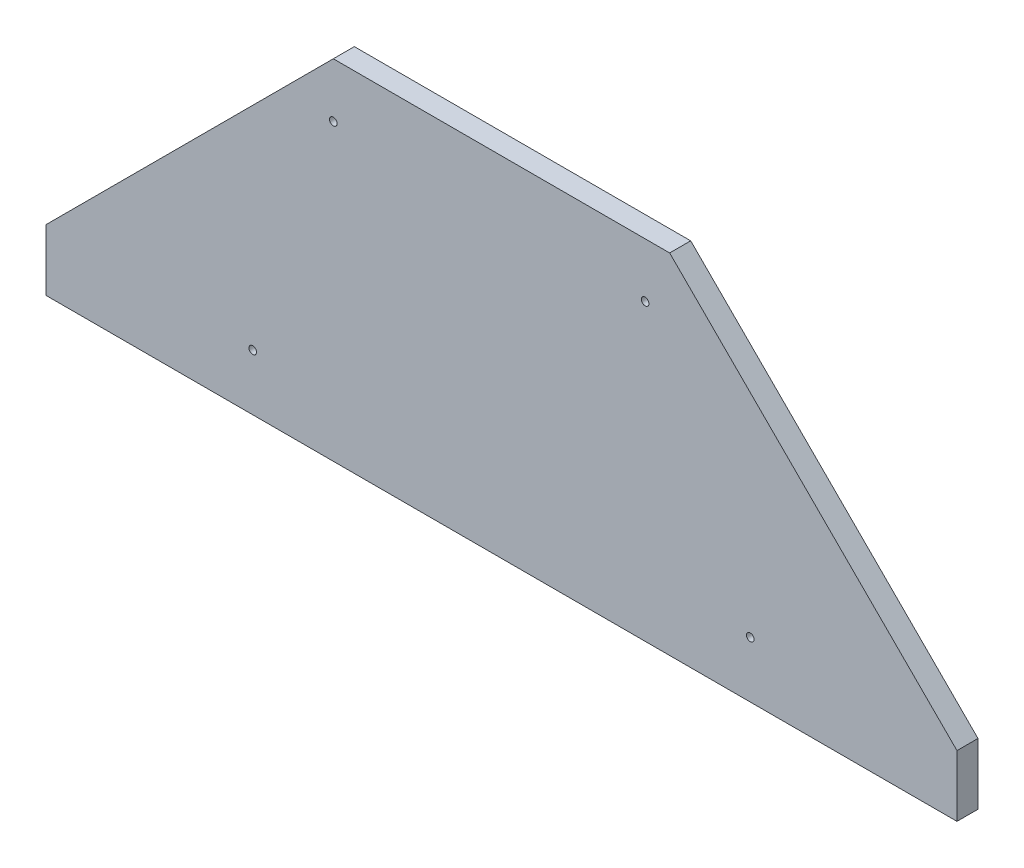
ISO-10303-21;
HEADER;
FILE_DESCRIPTION(('STEP AP214'),'2;1');
FILE_NAME('part.step','',(''),(''),'','','');
FILE_SCHEMA(('AUTOMOTIVE_DESIGN { 1 0 10303 214 1 1 1 1 }'));
ENDSEC;
DATA;
#1=APPLICATION_CONTEXT('core data for automotive mechanical design processes');
#2=APPLICATION_PROTOCOL_DEFINITION('international standard','automotive_design',2000,#1);
#3=PRODUCT_CONTEXT('',#1,'mechanical');
#4=PRODUCT('Part','Part','',(#3));
#5=PRODUCT_RELATED_PRODUCT_CATEGORY('part','',(#4));
#6=PRODUCT_DEFINITION_FORMATION('','',#4);
#7=PRODUCT_DEFINITION_CONTEXT('part definition',#1,'design');
#8=PRODUCT_DEFINITION('design','',#6,#7);
#9=PRODUCT_DEFINITION_SHAPE('','',#8);
#10=(LENGTH_UNIT() NAMED_UNIT(*) SI_UNIT(.MILLI.,.METRE.));
#11=(NAMED_UNIT(*) PLANE_ANGLE_UNIT() SI_UNIT($,.RADIAN.));
#12=(NAMED_UNIT(*) SI_UNIT($,.STERADIAN.) SOLID_ANGLE_UNIT());
#13=UNCERTAINTY_MEASURE_WITH_UNIT(LENGTH_MEASURE(1.E-05),#10,'distance_accuracy_value','');
#14=(GEOMETRIC_REPRESENTATION_CONTEXT(3) GLOBAL_UNCERTAINTY_ASSIGNED_CONTEXT((#13)) GLOBAL_UNIT_ASSIGNED_CONTEXT((#10,
#11,#12)) REPRESENTATION_CONTEXT('',''));
#15=CARTESIAN_POINT('',(0.,0.,0.));
#16=DIRECTION('',(0.,0.,1.));
#17=DIRECTION('',(1.,0.,0.));
#18=AXIS2_PLACEMENT_3D('',#15,#16,#17);
#19=CARTESIAN_POINT('',(0.,157.95625,9.525));
#20=DIRECTION('',(0.,1.,0.));
#21=DIRECTION('',(0.,0.,1.));
#22=AXIS2_PLACEMENT_3D('',#19,#20,#21);
#23=PLANE('',#22);
#24=DIRECTION('',(1.,0.,0.));
#25=VECTOR('',#24,1.);
#26=CARTESIAN_POINT('',(0.,157.95625,-9.525));
#27=LINE('',#26,#25);
#28=CARTESIAN_POINT('',(-152.4,157.95625,-9.525));
#29=VERTEX_POINT('',#28);
#30=CARTESIAN_POINT('',(152.4,157.95625,-9.525));
#31=VERTEX_POINT('',#30);
#32=EDGE_CURVE('E126',#29,#31,#27,.T.);
#33=ORIENTED_EDGE('',*,*,#32,.F.);
#34=DIRECTION('',(0.,0.,-1.));
#35=VECTOR('',#34,1.);
#36=CARTESIAN_POINT('',(-152.4,157.95625,9.525));
#37=LINE('',#36,#35);
#38=CARTESIAN_POINT('',(-152.4,157.95625,9.525));
#39=VERTEX_POINT('',#38);
#40=EDGE_CURVE('E11',#39,#29,#37,.T.);
#41=ORIENTED_EDGE('',*,*,#40,.F.);
#42=DIRECTION('',(1.,0.,0.));
#43=VECTOR('',#42,1.);
#44=CARTESIAN_POINT('',(0.,157.95625,9.525));
#45=LINE('',#44,#43);
#46=CARTESIAN_POINT('',(152.4,157.95625,9.525));
#47=VERTEX_POINT('',#46);
#48=EDGE_CURVE('E280',#39,#47,#45,.T.);
#49=ORIENTED_EDGE('',*,*,#48,.T.);
#50=DIRECTION('',(0.,0.,-1.));
#51=VECTOR('',#50,1.);
#52=CARTESIAN_POINT('',(152.4,157.95625,9.525));
#53=LINE('',#52,#51);
#54=EDGE_CURVE('E49',#47,#31,#53,.T.);
#55=ORIENTED_EDGE('',*,*,#54,.T.);
#56=EDGE_LOOP('',(#33,#41,#49,#55));
#57=FACE_BOUND('',#56,.T.);
#58=ADVANCED_FACE('F32',(#57),#23,.T.);
#59=CARTESIAN_POINT('',(-498.999046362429,-188.642796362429,9.525));
#60=DIRECTION('',(0.707106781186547,-0.707106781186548,0.));
#61=DIRECTION('',(0.707106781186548,0.707106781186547,0.));
#62=AXIS2_PLACEMENT_3D('',#59,#60,#61);
#63=PLANE('',#62);
#64=DIRECTION('',(-0.707106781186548,-0.707106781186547,0.));
#65=VECTOR('',#64,1.);
#66=CARTESIAN_POINT('',(-498.999046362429,-188.642796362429,-9.525));
#67=LINE('',#66,#65);
#68=CARTESIAN_POINT('',(-412.75,-102.39375,-9.525));
#69=VERTEX_POINT('',#68);
#70=EDGE_CURVE('E123',#29,#69,#67,.T.);
#71=ORIENTED_EDGE('',*,*,#70,.T.);
#72=DIRECTION('',(0.,0.,-1.));
#73=VECTOR('',#72,1.);
#74=CARTESIAN_POINT('',(-412.75,-102.39375,9.525));
#75=LINE('',#74,#73);
#76=CARTESIAN_POINT('',(-412.75,-102.39375,9.525));
#77=VERTEX_POINT('',#76);
#78=EDGE_CURVE('E41',#77,#69,#75,.T.);
#79=ORIENTED_EDGE('',*,*,#78,.F.);
#80=DIRECTION('',(-0.707106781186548,-0.707106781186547,0.));
#81=VECTOR('',#80,1.);
#82=CARTESIAN_POINT('',(-498.999046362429,-188.642796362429,9.525));
#83=LINE('',#82,#81);
#84=EDGE_CURVE('E282',#39,#77,#83,.T.);
#85=ORIENTED_EDGE('',*,*,#84,.F.);
#86=ORIENTED_EDGE('',*,*,#40,.T.);
#87=EDGE_LOOP('',(#71,#79,#85,#86));
#88=FACE_BOUND('',#87,.T.);
#89=ADVANCED_FACE('F124',(#88),#63,.F.);
#90=CARTESIAN_POINT('',(-412.75,-687.641842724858,9.525));
#91=DIRECTION('',(-1.,0.,0.));
#92=DIRECTION('',(0.,0.,1.));
#93=AXIS2_PLACEMENT_3D('',#90,#91,#92);
#94=PLANE('',#93);
#95=DIRECTION('',(0.,1.,0.));
#96=VECTOR('',#95,1.);
#97=CARTESIAN_POINT('',(-412.75,-687.641842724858,-9.525));
#98=LINE('',#97,#96);
#99=CARTESIAN_POINT('',(-412.75,-157.95625,-9.525));
#100=VERTEX_POINT('',#99);
#101=EDGE_CURVE('E120',#100,#69,#98,.T.);
#102=ORIENTED_EDGE('',*,*,#101,.F.);
#103=DIRECTION('',(0.,0.,-1.));
#104=VECTOR('',#103,1.);
#105=CARTESIAN_POINT('',(-412.75,-157.95625,9.525));
#106=LINE('',#105,#104);
#107=CARTESIAN_POINT('',(-412.75,-157.95625,9.525));
#108=VERTEX_POINT('',#107);
#109=EDGE_CURVE('E109',#108,#100,#106,.T.);
#110=ORIENTED_EDGE('',*,*,#109,.F.);
#111=DIRECTION('',(0.,1.,0.));
#112=VECTOR('',#111,1.);
#113=CARTESIAN_POINT('',(-412.75,-687.641842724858,9.525));
#114=LINE('',#113,#112);
#115=EDGE_CURVE('E103',#108,#77,#114,.T.);
#116=ORIENTED_EDGE('',*,*,#115,.T.);
#117=ORIENTED_EDGE('',*,*,#78,.T.);
#118=EDGE_LOOP('',(#102,#110,#116,#117));
#119=FACE_BOUND('',#118,.T.);
#120=ADVANCED_FACE('F118',(#119),#94,.T.);
#121=CARTESIAN_POINT('',(0.,-157.95625,9.525));
#122=DIRECTION('',(0.,1.,0.));
#123=DIRECTION('',(0.,0.,1.));
#124=AXIS2_PLACEMENT_3D('',#121,#122,#123);
#125=PLANE('',#124);
#126=DIRECTION('',(1.,0.,0.));
#127=VECTOR('',#126,1.);
#128=CARTESIAN_POINT('',(0.,-157.95625,-9.525));
#129=LINE('',#128,#127);
#130=CARTESIAN_POINT('',(412.75,-157.95625,-9.525));
#131=VERTEX_POINT('',#130);
#132=EDGE_CURVE('E108',#100,#131,#129,.T.);
#133=ORIENTED_EDGE('',*,*,#132,.T.);
#134=DIRECTION('',(0.,0.,-1.));
#135=VECTOR('',#134,1.);
#136=CARTESIAN_POINT('',(412.75,-157.95625,9.525));
#137=LINE('',#136,#135);
#138=CARTESIAN_POINT('',(412.75,-157.95625,9.525));
#139=VERTEX_POINT('',#138);
#140=EDGE_CURVE('E91',#139,#131,#137,.T.);
#141=ORIENTED_EDGE('',*,*,#140,.F.);
#142=DIRECTION('',(1.,0.,0.));
#143=VECTOR('',#142,1.);
#144=CARTESIAN_POINT('',(0.,-157.95625,9.525));
#145=LINE('',#144,#143);
#146=EDGE_CURVE('E96',#108,#139,#145,.T.);
#147=ORIENTED_EDGE('',*,*,#146,.F.);
#148=ORIENTED_EDGE('',*,*,#109,.T.);
#149=EDGE_LOOP('',(#133,#141,#147,#148));
#150=FACE_BOUND('',#149,.T.);
#151=ADVANCED_FACE('F106',(#150),#125,.F.);
#152=CARTESIAN_POINT('',(412.75,-687.641842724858,9.525));
#153=DIRECTION('',(-1.,0.,0.));
#154=DIRECTION('',(0.,0.,1.));
#155=AXIS2_PLACEMENT_3D('',#152,#153,#154);
#156=PLANE('',#155);
#157=DIRECTION('',(0.,1.,0.));
#158=VECTOR('',#157,1.);
#159=CARTESIAN_POINT('',(412.75,-687.641842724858,-9.525));
#160=LINE('',#159,#158);
#161=CARTESIAN_POINT('',(412.75,-102.39375,-9.525));
#162=VERTEX_POINT('',#161);
#163=EDGE_CURVE('E130',#131,#162,#160,.T.);
#164=ORIENTED_EDGE('',*,*,#163,.T.);
#165=DIRECTION('',(0.,0.,-1.));
#166=VECTOR('',#165,1.);
#167=CARTESIAN_POINT('',(412.75,-102.39375,9.525));
#168=LINE('',#167,#166);
#169=CARTESIAN_POINT('',(412.75,-102.39375,9.525));
#170=VERTEX_POINT('',#169);
#171=EDGE_CURVE('E69',#170,#162,#168,.T.);
#172=ORIENTED_EDGE('',*,*,#171,.F.);
#173=DIRECTION('',(0.,1.,0.));
#174=VECTOR('',#173,1.);
#175=CARTESIAN_POINT('',(412.75,-687.641842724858,9.525));
#176=LINE('',#175,#174);
#177=EDGE_CURVE('E87',#139,#170,#176,.T.);
#178=ORIENTED_EDGE('',*,*,#177,.F.);
#179=ORIENTED_EDGE('',*,*,#140,.T.);
#180=EDGE_LOOP('',(#164,#172,#178,#179));
#181=FACE_BOUND('',#180,.T.);
#182=ADVANCED_FACE('F89',(#181),#156,.F.);
#183=CARTESIAN_POINT('',(130.175,108.74375,9.525));
#184=DIRECTION('',(0.,0.,-1.));
#185=DIRECTION('',(-1.,0.,0.));
#186=AXIS2_PLACEMENT_3D('',#183,#184,#185);
#187=CYLINDRICAL_SURFACE('',#186,3.429);
#188=CARTESIAN_POINT('',(130.175,108.74375,9.525));
#189=DIRECTION('',(0.,0.,1.));
#190=DIRECTION('',(1.,0.,0.));
#191=AXIS2_PLACEMENT_3D('',#188,#189,#190);
#192=CIRCLE('',#191,3.429);
#193=CARTESIAN_POINT('',(126.746,108.74375,9.525));
#194=VERTEX_POINT('',#193);
#195=EDGE_CURVE('E273',#194,#194,#192,.T.);
#196=CARTESIAN_POINT('',(130.175,108.74375,-9.525));
#197=DIRECTION('',(0.,0.,1.));
#198=DIRECTION('',(1.,0.,0.));
#199=AXIS2_PLACEMENT_3D('',#196,#197,#198);
#200=CIRCLE('',#199,3.429);
#201=CARTESIAN_POINT('',(126.746,108.74375,-9.525));
#202=VERTEX_POINT('',#201);
#203=EDGE_CURVE('E149',#202,#202,#200,.T.);
#204=CARTESIAN_POINT('',(126.746,108.74375,9.525));
#205=CARTESIAN_POINT('',(126.746,108.74375,9.3265625));
#206=CARTESIAN_POINT('',(126.746,108.74375,9.128125));
#207=CARTESIAN_POINT('',(126.746,108.74375,8.73125));
#208=CARTESIAN_POINT('',(126.746,108.74375,8.5328125));
#209=CARTESIAN_POINT('',(126.746,108.74375,8.1359375));
#210=CARTESIAN_POINT('',(126.746,108.74375,7.9375));
#211=CARTESIAN_POINT('',(126.746,108.74375,7.540625));
#212=CARTESIAN_POINT('',(126.746,108.74375,7.3421875));
#213=CARTESIAN_POINT('',(126.746,108.74375,6.9453125));
#214=CARTESIAN_POINT('',(126.746,108.74375,6.746875));
#215=CARTESIAN_POINT('',(126.746,108.74375,6.35));
#216=CARTESIAN_POINT('',(126.746,108.74375,6.1515625));
#217=CARTESIAN_POINT('',(126.746,108.74375,5.7546875));
#218=CARTESIAN_POINT('',(126.746,108.74375,5.55625));
#219=CARTESIAN_POINT('',(126.746,108.74375,5.159375));
#220=CARTESIAN_POINT('',(126.746,108.74375,4.9609375));
#221=CARTESIAN_POINT('',(126.746,108.74375,4.5640625));
#222=CARTESIAN_POINT('',(126.746,108.74375,4.365625));
#223=CARTESIAN_POINT('',(126.746,108.74375,3.96875));
#224=CARTESIAN_POINT('',(126.746,108.74375,3.7703125));
#225=CARTESIAN_POINT('',(126.746,108.74375,3.3734375));
#226=CARTESIAN_POINT('',(126.746,108.74375,3.175));
#227=CARTESIAN_POINT('',(126.746,108.74375,2.778125));
#228=CARTESIAN_POINT('',(126.746,108.74375,2.5796875));
#229=CARTESIAN_POINT('',(126.746,108.74375,2.1828125));
#230=CARTESIAN_POINT('',(126.746,108.74375,1.984375));
#231=CARTESIAN_POINT('',(126.746,108.74375,1.5875));
#232=CARTESIAN_POINT('',(126.746,108.74375,1.3890625));
#233=CARTESIAN_POINT('',(126.746,108.74375,0.992187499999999));
#234=CARTESIAN_POINT('',(126.746,108.74375,0.793749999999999));
#235=CARTESIAN_POINT('',(126.746,108.74375,0.396874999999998));
#236=CARTESIAN_POINT('',(126.746,108.74375,0.198437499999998));
#237=CARTESIAN_POINT('',(126.746,108.74375,-0.198437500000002));
#238=CARTESIAN_POINT('',(126.746,108.74375,-0.396875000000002));
#239=CARTESIAN_POINT('',(126.746,108.74375,-0.793750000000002));
#240=CARTESIAN_POINT('',(126.746,108.74375,-0.992187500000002));
#241=CARTESIAN_POINT('',(126.746,108.74375,-1.3890625));
#242=CARTESIAN_POINT('',(126.746,108.74375,-1.5875));
#243=CARTESIAN_POINT('',(126.746,108.74375,-1.984375));
#244=CARTESIAN_POINT('',(126.746,108.74375,-2.1828125));
#245=CARTESIAN_POINT('',(126.746,108.74375,-2.5796875));
#246=CARTESIAN_POINT('',(126.746,108.74375,-2.778125));
#247=CARTESIAN_POINT('',(126.746,108.74375,-3.175));
#248=CARTESIAN_POINT('',(126.746,108.74375,-3.3734375));
#249=CARTESIAN_POINT('',(126.746,108.74375,-3.7703125));
#250=CARTESIAN_POINT('',(126.746,108.74375,-3.96875));
#251=CARTESIAN_POINT('',(126.746,108.74375,-4.365625));
#252=CARTESIAN_POINT('',(126.746,108.74375,-4.5640625));
#253=CARTESIAN_POINT('',(126.746,108.74375,-4.9609375));
#254=CARTESIAN_POINT('',(126.746,108.74375,-5.159375));
#255=CARTESIAN_POINT('',(126.746,108.74375,-5.55625));
#256=CARTESIAN_POINT('',(126.746,108.74375,-5.7546875));
#257=CARTESIAN_POINT('',(126.746,108.74375,-6.1515625));
#258=CARTESIAN_POINT('',(126.746,108.74375,-6.35));
#259=CARTESIAN_POINT('',(126.746,108.74375,-6.746875));
#260=CARTESIAN_POINT('',(126.746,108.74375,-6.9453125));
#261=CARTESIAN_POINT('',(126.746,108.74375,-7.3421875));
#262=CARTESIAN_POINT('',(126.746,108.74375,-7.540625));
#263=CARTESIAN_POINT('',(126.746,108.74375,-7.9375));
#264=CARTESIAN_POINT('',(126.746,108.74375,-8.1359375));
#265=CARTESIAN_POINT('',(126.746,108.74375,-8.5328125));
#266=CARTESIAN_POINT('',(126.746,108.74375,-8.73125));
#267=CARTESIAN_POINT('',(126.746,108.74375,-9.128125));
#268=CARTESIAN_POINT('',(126.746,108.74375,-9.3265625));
#269=CARTESIAN_POINT('',(126.746,108.74375,-9.525));
#270=B_SPLINE_CURVE_WITH_KNOTS('',3,(#204,#205,#206,#207,#208,#209,#210,#211,#212,#213,#214,
#215,#216,#217,#218,#219,#220,#221,#222,#223,#224,#225,#226,#227,#228,#229,#230,#231,#232,#233,
#234,#235,#236,#237,#238,#239,#240,#241,#242,#243,#244,#245,#246,#247,#248,#249,#250,#251,#252,
#253,#254,#255,#256,#257,#258,#259,#260,#261,#262,#263,#264,#265,#266,#267,#268,#269),
.UNSPECIFIED.,.F.,.F.,(4,2,2,2,2,2,2,2,2,2,2,2,2,2,2,2,2,2,2,2,2,2,2,2,2,2,2,2,2,2,2,2,4),(0.,
0.595312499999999,1.190625,1.7859375,2.38125,2.9765625,3.571875,4.1671875,4.7625,5.3578125,
5.953125,6.5484375,7.14375,7.7390625,8.334375,8.9296875,9.525,10.1203125,10.715625,11.3109375,
11.90625,12.5015625,13.096875,13.6921875,14.2875,14.8828125,15.478125,16.0734375,16.66875,
17.2640625,17.859375,18.4546875,19.05),.UNSPECIFIED.);
#271=EDGE_CURVE('BSEAM172',#194,#202,#270,.T.);
#272=ORIENTED_EDGE('',*,*,#195,.T.);
#273=ORIENTED_EDGE('',*,*,#203,.F.);
#274=ORIENTED_EDGE('',*,*,#271,.T.);
#275=ORIENTED_EDGE('',*,*,#271,.F.);
#276=EDGE_LOOP('',(#272,#274,#273,#275));
#277=FACE_BOUND('',#276,.T.);
#278=ADVANCED_FACE('F172',(#277),#187,.F.);
#279=CARTESIAN_POINT('',(-152.4,108.74375,9.525));
#280=DIRECTION('',(0.,0.,-1.));
#281=DIRECTION('',(-1.,0.,0.));
#282=AXIS2_PLACEMENT_3D('',#279,#280,#281);
#283=CYLINDRICAL_SURFACE('',#282,3.429);
#284=CARTESIAN_POINT('',(-152.4,108.74375,9.525));
#285=DIRECTION('',(0.,0.,1.));
#286=DIRECTION('',(1.,0.,0.));
#287=AXIS2_PLACEMENT_3D('',#284,#285,#286);
#288=CIRCLE('',#287,3.429);
#289=CARTESIAN_POINT('',(-155.829,108.74375,9.525));
#290=VERTEX_POINT('',#289);
#291=EDGE_CURVE('E270',#290,#290,#288,.T.);
#292=CARTESIAN_POINT('',(-152.4,108.74375,-9.525));
#293=DIRECTION('',(0.,0.,1.));
#294=DIRECTION('',(1.,0.,0.));
#295=AXIS2_PLACEMENT_3D('',#292,#293,#294);
#296=CIRCLE('',#295,3.429);
#297=CARTESIAN_POINT('',(-155.829,108.74375,-9.525));
#298=VERTEX_POINT('',#297);
#299=EDGE_CURVE('E146',#298,#298,#296,.T.);
#300=CARTESIAN_POINT('',(-155.829,108.74375,9.525));
#301=CARTESIAN_POINT('',(-155.829,108.74375,9.3265625));
#302=CARTESIAN_POINT('',(-155.829,108.74375,9.128125));
#303=CARTESIAN_POINT('',(-155.829,108.74375,8.73125));
#304=CARTESIAN_POINT('',(-155.829,108.74375,8.5328125));
#305=CARTESIAN_POINT('',(-155.829,108.74375,8.1359375));
#306=CARTESIAN_POINT('',(-155.829,108.74375,7.9375));
#307=CARTESIAN_POINT('',(-155.829,108.74375,7.540625));
#308=CARTESIAN_POINT('',(-155.829,108.74375,7.3421875));
#309=CARTESIAN_POINT('',(-155.829,108.74375,6.9453125));
#310=CARTESIAN_POINT('',(-155.829,108.74375,6.746875));
#311=CARTESIAN_POINT('',(-155.829,108.74375,6.35));
#312=CARTESIAN_POINT('',(-155.829,108.74375,6.1515625));
#313=CARTESIAN_POINT('',(-155.829,108.74375,5.7546875));
#314=CARTESIAN_POINT('',(-155.829,108.74375,5.55625));
#315=CARTESIAN_POINT('',(-155.829,108.74375,5.159375));
#316=CARTESIAN_POINT('',(-155.829,108.74375,4.9609375));
#317=CARTESIAN_POINT('',(-155.829,108.74375,4.5640625));
#318=CARTESIAN_POINT('',(-155.829,108.74375,4.365625));
#319=CARTESIAN_POINT('',(-155.829,108.74375,3.96875));
#320=CARTESIAN_POINT('',(-155.829,108.74375,3.7703125));
#321=CARTESIAN_POINT('',(-155.829,108.74375,3.3734375));
#322=CARTESIAN_POINT('',(-155.829,108.74375,3.175));
#323=CARTESIAN_POINT('',(-155.829,108.74375,2.778125));
#324=CARTESIAN_POINT('',(-155.829,108.74375,2.5796875));
#325=CARTESIAN_POINT('',(-155.829,108.74375,2.1828125));
#326=CARTESIAN_POINT('',(-155.829,108.74375,1.984375));
#327=CARTESIAN_POINT('',(-155.829,108.74375,1.5875));
#328=CARTESIAN_POINT('',(-155.829,108.74375,1.3890625));
#329=CARTESIAN_POINT('',(-155.829,108.74375,0.992187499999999));
#330=CARTESIAN_POINT('',(-155.829,108.74375,0.793749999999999));
#331=CARTESIAN_POINT('',(-155.829,108.74375,0.396874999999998));
#332=CARTESIAN_POINT('',(-155.829,108.74375,0.198437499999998));
#333=CARTESIAN_POINT('',(-155.829,108.74375,-0.198437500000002));
#334=CARTESIAN_POINT('',(-155.829,108.74375,-0.396875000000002));
#335=CARTESIAN_POINT('',(-155.829,108.74375,-0.793750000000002));
#336=CARTESIAN_POINT('',(-155.829,108.74375,-0.992187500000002));
#337=CARTESIAN_POINT('',(-155.829,108.74375,-1.3890625));
#338=CARTESIAN_POINT('',(-155.829,108.74375,-1.5875));
#339=CARTESIAN_POINT('',(-155.829,108.74375,-1.984375));
#340=CARTESIAN_POINT('',(-155.829,108.74375,-2.1828125));
#341=CARTESIAN_POINT('',(-155.829,108.74375,-2.5796875));
#342=CARTESIAN_POINT('',(-155.829,108.74375,-2.778125));
#343=CARTESIAN_POINT('',(-155.829,108.74375,-3.175));
#344=CARTESIAN_POINT('',(-155.829,108.74375,-3.3734375));
#345=CARTESIAN_POINT('',(-155.829,108.74375,-3.7703125));
#346=CARTESIAN_POINT('',(-155.829,108.74375,-3.96875));
#347=CARTESIAN_POINT('',(-155.829,108.74375,-4.365625));
#348=CARTESIAN_POINT('',(-155.829,108.74375,-4.5640625));
#349=CARTESIAN_POINT('',(-155.829,108.74375,-4.9609375));
#350=CARTESIAN_POINT('',(-155.829,108.74375,-5.159375));
#351=CARTESIAN_POINT('',(-155.829,108.74375,-5.55625));
#352=CARTESIAN_POINT('',(-155.829,108.74375,-5.7546875));
#353=CARTESIAN_POINT('',(-155.829,108.74375,-6.1515625));
#354=CARTESIAN_POINT('',(-155.829,108.74375,-6.35));
#355=CARTESIAN_POINT('',(-155.829,108.74375,-6.746875));
#356=CARTESIAN_POINT('',(-155.829,108.74375,-6.9453125));
#357=CARTESIAN_POINT('',(-155.829,108.74375,-7.3421875));
#358=CARTESIAN_POINT('',(-155.829,108.74375,-7.540625));
#359=CARTESIAN_POINT('',(-155.829,108.74375,-7.9375));
#360=CARTESIAN_POINT('',(-155.829,108.74375,-8.1359375));
#361=CARTESIAN_POINT('',(-155.829,108.74375,-8.5328125));
#362=CARTESIAN_POINT('',(-155.829,108.74375,-8.73125));
#363=CARTESIAN_POINT('',(-155.829,108.74375,-9.128125));
#364=CARTESIAN_POINT('',(-155.829,108.74375,-9.3265625));
#365=CARTESIAN_POINT('',(-155.829,108.74375,-9.525));
#366=B_SPLINE_CURVE_WITH_KNOTS('',3,(#300,#301,#302,#303,#304,#305,#306,#307,#308,#309,#310,
#311,#312,#313,#314,#315,#316,#317,#318,#319,#320,#321,#322,#323,#324,#325,#326,#327,#328,#329,
#330,#331,#332,#333,#334,#335,#336,#337,#338,#339,#340,#341,#342,#343,#344,#345,#346,#347,#348,
#349,#350,#351,#352,#353,#354,#355,#356,#357,#358,#359,#360,#361,#362,#363,#364,#365),
.UNSPECIFIED.,.F.,.F.,(4,2,2,2,2,2,2,2,2,2,2,2,2,2,2,2,2,2,2,2,2,2,2,2,2,2,2,2,2,2,2,2,4),(0.,
0.595312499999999,1.190625,1.7859375,2.38125,2.9765625,3.571875,4.1671875,4.7625,5.3578125,
5.953125,6.5484375,7.14375,7.7390625,8.334375,8.9296875,9.525,10.1203125,10.715625,11.3109375,
11.90625,12.5015625,13.096875,13.6921875,14.2875,14.8828125,15.478125,16.0734375,16.66875,
17.2640625,17.859375,18.4546875,19.05),.UNSPECIFIED.);
#367=EDGE_CURVE('BSEAM175',#290,#298,#366,.T.);
#368=ORIENTED_EDGE('',*,*,#291,.T.);
#369=ORIENTED_EDGE('',*,*,#299,.F.);
#370=ORIENTED_EDGE('',*,*,#367,.T.);
#371=ORIENTED_EDGE('',*,*,#367,.F.);
#372=EDGE_LOOP('',(#368,#370,#369,#371));
#373=FACE_BOUND('',#372,.T.);
#374=ADVANCED_FACE('F175',(#373),#283,.F.);
#375=CARTESIAN_POINT('',(-225.425,-107.15625,9.525));
#376=DIRECTION('',(0.,0.,-1.));
#377=DIRECTION('',(-1.,0.,0.));
#378=AXIS2_PLACEMENT_3D('',#375,#376,#377);
#379=CYLINDRICAL_SURFACE('',#378,3.429);
#380=CARTESIAN_POINT('',(-225.425,-107.15625,9.525));
#381=DIRECTION('',(0.,0.,1.));
#382=DIRECTION('',(1.,0.,0.));
#383=AXIS2_PLACEMENT_3D('',#380,#381,#382);
#384=CIRCLE('',#383,3.429);
#385=CARTESIAN_POINT('',(-228.854,-107.15625,9.525));
#386=VERTEX_POINT('',#385);
#387=EDGE_CURVE('E186',#386,#386,#384,.T.);
#388=CARTESIAN_POINT('',(-225.425,-107.15625,-9.525));
#389=DIRECTION('',(0.,0.,1.));
#390=DIRECTION('',(1.,0.,0.));
#391=AXIS2_PLACEMENT_3D('',#388,#389,#390);
#392=CIRCLE('',#391,3.429);
#393=CARTESIAN_POINT('',(-228.854,-107.15625,-9.525));
#394=VERTEX_POINT('',#393);
#395=EDGE_CURVE('E143',#394,#394,#392,.T.);
#396=CARTESIAN_POINT('',(-228.854,-107.15625,9.525));
#397=CARTESIAN_POINT('',(-228.854,-107.15625,9.3265625));
#398=CARTESIAN_POINT('',(-228.854,-107.15625,9.128125));
#399=CARTESIAN_POINT('',(-228.854,-107.15625,8.73125));
#400=CARTESIAN_POINT('',(-228.854,-107.15625,8.5328125));
#401=CARTESIAN_POINT('',(-228.854,-107.15625,8.1359375));
#402=CARTESIAN_POINT('',(-228.854,-107.15625,7.9375));
#403=CARTESIAN_POINT('',(-228.854,-107.15625,7.540625));
#404=CARTESIAN_POINT('',(-228.854,-107.15625,7.3421875));
#405=CARTESIAN_POINT('',(-228.854,-107.15625,6.9453125));
#406=CARTESIAN_POINT('',(-228.854,-107.15625,6.746875));
#407=CARTESIAN_POINT('',(-228.854,-107.15625,6.35));
#408=CARTESIAN_POINT('',(-228.854,-107.15625,6.1515625));
#409=CARTESIAN_POINT('',(-228.854,-107.15625,5.7546875));
#410=CARTESIAN_POINT('',(-228.854,-107.15625,5.55625));
#411=CARTESIAN_POINT('',(-228.854,-107.15625,5.159375));
#412=CARTESIAN_POINT('',(-228.854,-107.15625,4.9609375));
#413=CARTESIAN_POINT('',(-228.854,-107.15625,4.5640625));
#414=CARTESIAN_POINT('',(-228.854,-107.15625,4.365625));
#415=CARTESIAN_POINT('',(-228.854,-107.15625,3.96875));
#416=CARTESIAN_POINT('',(-228.854,-107.15625,3.7703125));
#417=CARTESIAN_POINT('',(-228.854,-107.15625,3.3734375));
#418=CARTESIAN_POINT('',(-228.854,-107.15625,3.175));
#419=CARTESIAN_POINT('',(-228.854,-107.15625,2.778125));
#420=CARTESIAN_POINT('',(-228.854,-107.15625,2.5796875));
#421=CARTESIAN_POINT('',(-228.854,-107.15625,2.1828125));
#422=CARTESIAN_POINT('',(-228.854,-107.15625,1.984375));
#423=CARTESIAN_POINT('',(-228.854,-107.15625,1.5875));
#424=CARTESIAN_POINT('',(-228.854,-107.15625,1.3890625));
#425=CARTESIAN_POINT('',(-228.854,-107.15625,0.992187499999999));
#426=CARTESIAN_POINT('',(-228.854,-107.15625,0.793749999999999));
#427=CARTESIAN_POINT('',(-228.854,-107.15625,0.396874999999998));
#428=CARTESIAN_POINT('',(-228.854,-107.15625,0.198437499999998));
#429=CARTESIAN_POINT('',(-228.854,-107.15625,-0.198437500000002));
#430=CARTESIAN_POINT('',(-228.854,-107.15625,-0.396875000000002));
#431=CARTESIAN_POINT('',(-228.854,-107.15625,-0.793750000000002));
#432=CARTESIAN_POINT('',(-228.854,-107.15625,-0.992187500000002));
#433=CARTESIAN_POINT('',(-228.854,-107.15625,-1.3890625));
#434=CARTESIAN_POINT('',(-228.854,-107.15625,-1.5875));
#435=CARTESIAN_POINT('',(-228.854,-107.15625,-1.984375));
#436=CARTESIAN_POINT('',(-228.854,-107.15625,-2.1828125));
#437=CARTESIAN_POINT('',(-228.854,-107.15625,-2.5796875));
#438=CARTESIAN_POINT('',(-228.854,-107.15625,-2.778125));
#439=CARTESIAN_POINT('',(-228.854,-107.15625,-3.175));
#440=CARTESIAN_POINT('',(-228.854,-107.15625,-3.3734375));
#441=CARTESIAN_POINT('',(-228.854,-107.15625,-3.7703125));
#442=CARTESIAN_POINT('',(-228.854,-107.15625,-3.96875));
#443=CARTESIAN_POINT('',(-228.854,-107.15625,-4.365625));
#444=CARTESIAN_POINT('',(-228.854,-107.15625,-4.5640625));
#445=CARTESIAN_POINT('',(-228.854,-107.15625,-4.9609375));
#446=CARTESIAN_POINT('',(-228.854,-107.15625,-5.159375));
#447=CARTESIAN_POINT('',(-228.854,-107.15625,-5.55625));
#448=CARTESIAN_POINT('',(-228.854,-107.15625,-5.7546875));
#449=CARTESIAN_POINT('',(-228.854,-107.15625,-6.1515625));
#450=CARTESIAN_POINT('',(-228.854,-107.15625,-6.35));
#451=CARTESIAN_POINT('',(-228.854,-107.15625,-6.746875));
#452=CARTESIAN_POINT('',(-228.854,-107.15625,-6.9453125));
#453=CARTESIAN_POINT('',(-228.854,-107.15625,-7.3421875));
#454=CARTESIAN_POINT('',(-228.854,-107.15625,-7.540625));
#455=CARTESIAN_POINT('',(-228.854,-107.15625,-7.9375));
#456=CARTESIAN_POINT('',(-228.854,-107.15625,-8.1359375));
#457=CARTESIAN_POINT('',(-228.854,-107.15625,-8.5328125));
#458=CARTESIAN_POINT('',(-228.854,-107.15625,-8.73125));
#459=CARTESIAN_POINT('',(-228.854,-107.15625,-9.128125));
#460=CARTESIAN_POINT('',(-228.854,-107.15625,-9.3265625));
#461=CARTESIAN_POINT('',(-228.854,-107.15625,-9.525));
#462=B_SPLINE_CURVE_WITH_KNOTS('',3,(#396,#397,#398,#399,#400,#401,#402,#403,#404,#405,#406,
#407,#408,#409,#410,#411,#412,#413,#414,#415,#416,#417,#418,#419,#420,#421,#422,#423,#424,#425,
#426,#427,#428,#429,#430,#431,#432,#433,#434,#435,#436,#437,#438,#439,#440,#441,#442,#443,#444,
#445,#446,#447,#448,#449,#450,#451,#452,#453,#454,#455,#456,#457,#458,#459,#460,#461),
.UNSPECIFIED.,.F.,.F.,(4,2,2,2,2,2,2,2,2,2,2,2,2,2,2,2,2,2,2,2,2,2,2,2,2,2,2,2,2,2,2,2,4),(0.,
0.595312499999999,1.190625,1.7859375,2.38125,2.9765625,3.571875,4.1671875,4.7625,5.3578125,
5.953125,6.5484375,7.14375,7.7390625,8.334375,8.9296875,9.525,10.1203125,10.715625,11.3109375,
11.90625,12.5015625,13.096875,13.6921875,14.2875,14.8828125,15.478125,16.0734375,16.66875,
17.2640625,17.859375,18.4546875,19.05),.UNSPECIFIED.);
#463=EDGE_CURVE('BSEAM160',#386,#394,#462,.T.);
#464=ORIENTED_EDGE('',*,*,#387,.T.);
#465=ORIENTED_EDGE('',*,*,#395,.F.);
#466=ORIENTED_EDGE('',*,*,#463,.T.);
#467=ORIENTED_EDGE('',*,*,#463,.F.);
#468=EDGE_LOOP('',(#464,#466,#465,#467));
#469=FACE_BOUND('',#468,.T.);
#470=ADVANCED_FACE('F160',(#469),#379,.F.);
#471=CARTESIAN_POINT('',(225.425,-107.15625,9.525));
#472=DIRECTION('',(0.,0.,-1.));
#473=DIRECTION('',(-1.,0.,0.));
#474=AXIS2_PLACEMENT_3D('',#471,#472,#473);
#475=CYLINDRICAL_SURFACE('',#474,3.429);
#476=CARTESIAN_POINT('',(225.425,-107.15625,9.525));
#477=DIRECTION('',(0.,0.,1.));
#478=DIRECTION('',(1.,0.,0.));
#479=AXIS2_PLACEMENT_3D('',#476,#477,#478);
#480=CIRCLE('',#479,3.429);
#481=CARTESIAN_POINT('',(221.996,-107.15625,9.525));
#482=VERTEX_POINT('',#481);
#483=EDGE_CURVE('E137',#482,#482,#480,.T.);
#484=CARTESIAN_POINT('',(225.425,-107.15625,-9.525));
#485=DIRECTION('',(0.,0.,1.));
#486=DIRECTION('',(1.,0.,0.));
#487=AXIS2_PLACEMENT_3D('',#484,#485,#486);
#488=CIRCLE('',#487,3.429);
#489=CARTESIAN_POINT('',(221.996,-107.15625,-9.525));
#490=VERTEX_POINT('',#489);
#491=EDGE_CURVE('E140',#490,#490,#488,.T.);
#492=CARTESIAN_POINT('',(221.996,-107.15625,9.525));
#493=CARTESIAN_POINT('',(221.996,-107.15625,9.3265625));
#494=CARTESIAN_POINT('',(221.996,-107.15625,9.128125));
#495=CARTESIAN_POINT('',(221.996,-107.15625,8.73125));
#496=CARTESIAN_POINT('',(221.996,-107.15625,8.5328125));
#497=CARTESIAN_POINT('',(221.996,-107.15625,8.1359375));
#498=CARTESIAN_POINT('',(221.996,-107.15625,7.9375));
#499=CARTESIAN_POINT('',(221.996,-107.15625,7.540625));
#500=CARTESIAN_POINT('',(221.996,-107.15625,7.3421875));
#501=CARTESIAN_POINT('',(221.996,-107.15625,6.9453125));
#502=CARTESIAN_POINT('',(221.996,-107.15625,6.746875));
#503=CARTESIAN_POINT('',(221.996,-107.15625,6.35));
#504=CARTESIAN_POINT('',(221.996,-107.15625,6.1515625));
#505=CARTESIAN_POINT('',(221.996,-107.15625,5.7546875));
#506=CARTESIAN_POINT('',(221.996,-107.15625,5.55625));
#507=CARTESIAN_POINT('',(221.996,-107.15625,5.159375));
#508=CARTESIAN_POINT('',(221.996,-107.15625,4.9609375));
#509=CARTESIAN_POINT('',(221.996,-107.15625,4.5640625));
#510=CARTESIAN_POINT('',(221.996,-107.15625,4.365625));
#511=CARTESIAN_POINT('',(221.996,-107.15625,3.96875));
#512=CARTESIAN_POINT('',(221.996,-107.15625,3.7703125));
#513=CARTESIAN_POINT('',(221.996,-107.15625,3.3734375));
#514=CARTESIAN_POINT('',(221.996,-107.15625,3.175));
#515=CARTESIAN_POINT('',(221.996,-107.15625,2.778125));
#516=CARTESIAN_POINT('',(221.996,-107.15625,2.5796875));
#517=CARTESIAN_POINT('',(221.996,-107.15625,2.1828125));
#518=CARTESIAN_POINT('',(221.996,-107.15625,1.984375));
#519=CARTESIAN_POINT('',(221.996,-107.15625,1.5875));
#520=CARTESIAN_POINT('',(221.996,-107.15625,1.3890625));
#521=CARTESIAN_POINT('',(221.996,-107.15625,0.992187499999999));
#522=CARTESIAN_POINT('',(221.996,-107.15625,0.793749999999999));
#523=CARTESIAN_POINT('',(221.996,-107.15625,0.396874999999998));
#524=CARTESIAN_POINT('',(221.996,-107.15625,0.198437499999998));
#525=CARTESIAN_POINT('',(221.996,-107.15625,-0.198437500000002));
#526=CARTESIAN_POINT('',(221.996,-107.15625,-0.396875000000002));
#527=CARTESIAN_POINT('',(221.996,-107.15625,-0.793750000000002));
#528=CARTESIAN_POINT('',(221.996,-107.15625,-0.992187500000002));
#529=CARTESIAN_POINT('',(221.996,-107.15625,-1.3890625));
#530=CARTESIAN_POINT('',(221.996,-107.15625,-1.5875));
#531=CARTESIAN_POINT('',(221.996,-107.15625,-1.984375));
#532=CARTESIAN_POINT('',(221.996,-107.15625,-2.1828125));
#533=CARTESIAN_POINT('',(221.996,-107.15625,-2.5796875));
#534=CARTESIAN_POINT('',(221.996,-107.15625,-2.778125));
#535=CARTESIAN_POINT('',(221.996,-107.15625,-3.175));
#536=CARTESIAN_POINT('',(221.996,-107.15625,-3.3734375));
#537=CARTESIAN_POINT('',(221.996,-107.15625,-3.7703125));
#538=CARTESIAN_POINT('',(221.996,-107.15625,-3.96875));
#539=CARTESIAN_POINT('',(221.996,-107.15625,-4.365625));
#540=CARTESIAN_POINT('',(221.996,-107.15625,-4.5640625));
#541=CARTESIAN_POINT('',(221.996,-107.15625,-4.9609375));
#542=CARTESIAN_POINT('',(221.996,-107.15625,-5.159375));
#543=CARTESIAN_POINT('',(221.996,-107.15625,-5.55625));
#544=CARTESIAN_POINT('',(221.996,-107.15625,-5.7546875));
#545=CARTESIAN_POINT('',(221.996,-107.15625,-6.1515625));
#546=CARTESIAN_POINT('',(221.996,-107.15625,-6.35));
#547=CARTESIAN_POINT('',(221.996,-107.15625,-6.746875));
#548=CARTESIAN_POINT('',(221.996,-107.15625,-6.9453125));
#549=CARTESIAN_POINT('',(221.996,-107.15625,-7.3421875));
#550=CARTESIAN_POINT('',(221.996,-107.15625,-7.540625));
#551=CARTESIAN_POINT('',(221.996,-107.15625,-7.9375));
#552=CARTESIAN_POINT('',(221.996,-107.15625,-8.1359375));
#553=CARTESIAN_POINT('',(221.996,-107.15625,-8.5328125));
#554=CARTESIAN_POINT('',(221.996,-107.15625,-8.73125));
#555=CARTESIAN_POINT('',(221.996,-107.15625,-9.128125));
#556=CARTESIAN_POINT('',(221.996,-107.15625,-9.3265625));
#557=CARTESIAN_POINT('',(221.996,-107.15625,-9.525));
#558=B_SPLINE_CURVE_WITH_KNOTS('',3,(#492,#493,#494,#495,#496,#497,#498,#499,#500,#501,#502,
#503,#504,#505,#506,#507,#508,#509,#510,#511,#512,#513,#514,#515,#516,#517,#518,#519,#520,#521,
#522,#523,#524,#525,#526,#527,#528,#529,#530,#531,#532,#533,#534,#535,#536,#537,#538,#539,#540,
#541,#542,#543,#544,#545,#546,#547,#548,#549,#550,#551,#552,#553,#554,#555,#556,#557),
.UNSPECIFIED.,.F.,.F.,(4,2,2,2,2,2,2,2,2,2,2,2,2,2,2,2,2,2,2,2,2,2,2,2,2,2,2,2,2,2,2,2,4),(0.,
0.595312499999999,1.190625,1.7859375,2.38125,2.9765625,3.571875,4.1671875,4.7625,5.3578125,
5.953125,6.5484375,7.14375,7.7390625,8.334375,8.9296875,9.525,10.1203125,10.715625,11.3109375,
11.90625,12.5015625,13.096875,13.6921875,14.2875,14.8828125,15.478125,16.0734375,16.66875,
17.2640625,17.859375,18.4546875,19.05),.UNSPECIFIED.);
#559=EDGE_CURVE('BSEAM34',#482,#490,#558,.T.);
#560=ORIENTED_EDGE('',*,*,#483,.T.);
#561=ORIENTED_EDGE('',*,*,#491,.F.);
#562=ORIENTED_EDGE('',*,*,#559,.T.);
#563=ORIENTED_EDGE('',*,*,#559,.F.);
#564=EDGE_LOOP('',(#560,#562,#561,#563));
#565=FACE_BOUND('',#564,.T.);
#566=ADVANCED_FACE('F34',(#565),#475,.F.);
#567=CARTESIAN_POINT('',(498.999046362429,-188.642796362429,9.525));
#568=DIRECTION('',(0.707106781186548,0.707106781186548,0.));
#569=DIRECTION('',(-0.707106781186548,0.707106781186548,0.));
#570=AXIS2_PLACEMENT_3D('',#567,#568,#569);
#571=PLANE('',#570);
#572=DIRECTION('',(0.707106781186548,-0.707106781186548,0.));
#573=VECTOR('',#572,1.);
#574=CARTESIAN_POINT('',(498.999046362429,-188.642796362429,-9.525));
#575=LINE('',#574,#573);
#576=EDGE_CURVE('E135',#31,#162,#575,.T.);
#577=ORIENTED_EDGE('',*,*,#576,.F.);
#578=ORIENTED_EDGE('',*,*,#54,.F.);
#579=DIRECTION('',(0.707106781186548,-0.707106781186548,0.));
#580=VECTOR('',#579,1.);
#581=CARTESIAN_POINT('',(498.999046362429,-188.642796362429,9.525));
#582=LINE('',#581,#580);
#583=EDGE_CURVE('E95',#47,#170,#582,.T.);
#584=ORIENTED_EDGE('',*,*,#583,.T.);
#585=ORIENTED_EDGE('',*,*,#171,.T.);
#586=EDGE_LOOP('',(#577,#578,#584,#585));
#587=FACE_BOUND('',#586,.T.);
#588=ADVANCED_FACE('F151',(#587),#571,.T.);
#589=CARTESIAN_POINT('',(0.,-687.641842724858,9.525));
#590=DIRECTION('',(0.,0.,1.));
#591=DIRECTION('',(1.,0.,0.));
#592=AXIS2_PLACEMENT_3D('',#589,#590,#591);
#593=PLANE('',#592);
#594=ORIENTED_EDGE('',*,*,#483,.F.);
#595=EDGE_LOOP('',(#594));
#596=FACE_BOUND('',#595,.T.);
#597=ORIENTED_EDGE('',*,*,#387,.F.);
#598=EDGE_LOOP('',(#597));
#599=FACE_BOUND('',#598,.T.);
#600=ORIENTED_EDGE('',*,*,#291,.F.);
#601=EDGE_LOOP('',(#600));
#602=FACE_BOUND('',#601,.T.);
#603=ORIENTED_EDGE('',*,*,#195,.F.);
#604=EDGE_LOOP('',(#603));
#605=FACE_BOUND('',#604,.T.);
#606=ORIENTED_EDGE('',*,*,#48,.F.);
#607=ORIENTED_EDGE('',*,*,#84,.T.);
#608=ORIENTED_EDGE('',*,*,#115,.F.);
#609=ORIENTED_EDGE('',*,*,#146,.T.);
#610=ORIENTED_EDGE('',*,*,#177,.T.);
#611=ORIENTED_EDGE('',*,*,#583,.F.);
#612=EDGE_LOOP('',(#606,#607,#608,#609,#610,#611));
#613=FACE_BOUND('',#612,.T.);
#614=ADVANCED_FACE('F101',(#596,#599,#602,#605,#613),#593,.T.);
#615=CARTESIAN_POINT('',(0.,-687.641842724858,-9.525));
#616=DIRECTION('',(0.,0.,1.));
#617=DIRECTION('',(1.,0.,0.));
#618=AXIS2_PLACEMENT_3D('',#615,#616,#617);
#619=PLANE('',#618);
#620=ORIENTED_EDGE('',*,*,#491,.T.);
#621=EDGE_LOOP('',(#620));
#622=FACE_BOUND('',#621,.T.);
#623=ORIENTED_EDGE('',*,*,#395,.T.);
#624=EDGE_LOOP('',(#623));
#625=FACE_BOUND('',#624,.T.);
#626=ORIENTED_EDGE('',*,*,#299,.T.);
#627=EDGE_LOOP('',(#626));
#628=FACE_BOUND('',#627,.T.);
#629=ORIENTED_EDGE('',*,*,#203,.T.);
#630=EDGE_LOOP('',(#629));
#631=FACE_BOUND('',#630,.T.);
#632=ORIENTED_EDGE('',*,*,#32,.T.);
#633=ORIENTED_EDGE('',*,*,#576,.T.);
#634=ORIENTED_EDGE('',*,*,#163,.F.);
#635=ORIENTED_EDGE('',*,*,#132,.F.);
#636=ORIENTED_EDGE('',*,*,#101,.T.);
#637=ORIENTED_EDGE('',*,*,#70,.F.);
#638=EDGE_LOOP('',(#632,#633,#634,#635,#636,#637));
#639=FACE_BOUND('',#638,.T.);
#640=ADVANCED_FACE('F128',(#622,#625,#628,#631,#639),#619,.F.);
#641=CLOSED_SHELL('',(#58,#89,#120,#151,#182,#278,#374,#470,#566,#588,#614,#640));
#642=MANIFOLD_SOLID_BREP('B2',#641);
#643=ADVANCED_BREP_SHAPE_REPRESENTATION('',(#18,#642),#14);
#644=SHAPE_DEFINITION_REPRESENTATION(#9,#643);
ENDSEC;
END-ISO-10303-21;
